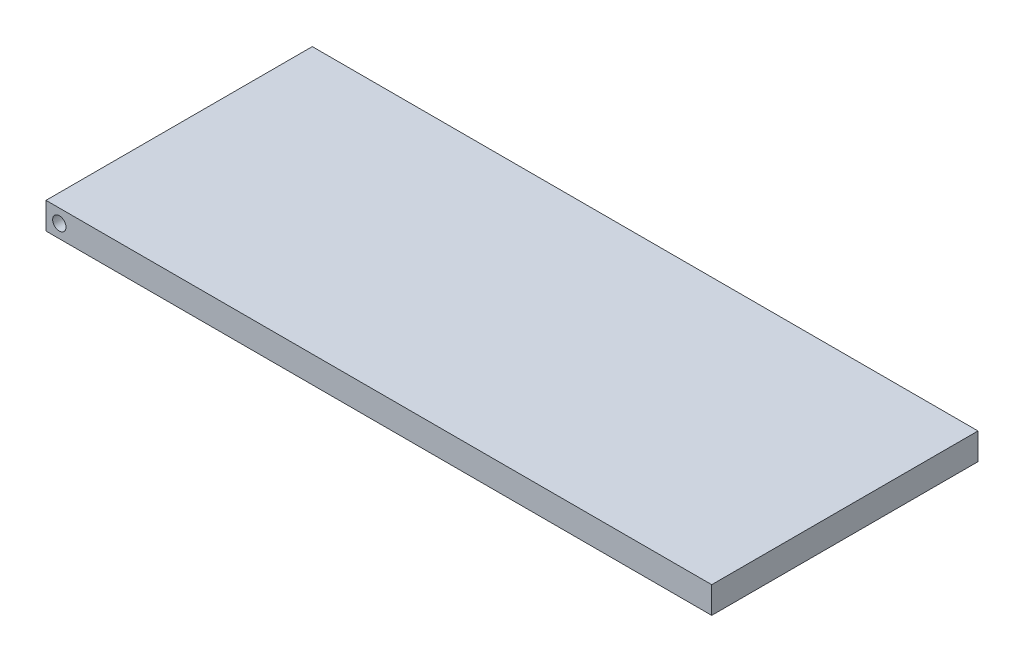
from build123d import *

# Parameters (mm, degrees)
ESQUISSE1_W             = 500
ESQUISSE1_H             = 20
BOSS_EXTRU_1_DEPTH      = 200
ESQUISSE2_R             = 5
ENL_V_MAT_EXTRU_1_DEPTH = 539.887743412


with BuildPart() as part:
    # Esquisse1 → Boss.-Extru.1 (new body)
    with BuildSketch(Plane.XY):
        with Locations((250, 10)):
            Rectangle(ESQUISSE1_W, ESQUISSE1_H)
    extrude(amount=-BOSS_EXTRU_1_DEPTH)

    # Esquisse2 → Enl_v. mat.-Extru.1 (cut, through all)
    with BuildSketch(Plane.XY):
        with Locations((10, 10)):
            Circle(ESQUISSE2_R)
    extrude(amount=-ENL_V_MAT_EXTRU_1_DEPTH, mode=Mode.SUBTRACT)


solid = part.part
